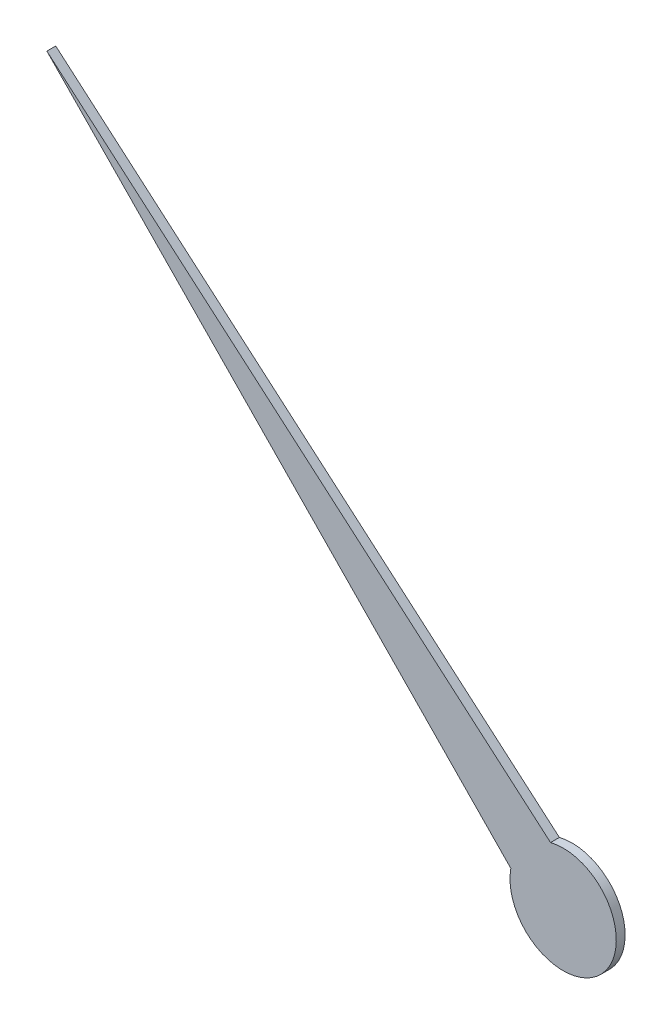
ISO-10303-21;
HEADER;
FILE_DESCRIPTION(('STEP AP214'),'2;1');
FILE_NAME('part.step','',(''),(''),'','','');
FILE_SCHEMA(('AUTOMOTIVE_DESIGN { 1 0 10303 214 1 1 1 1 }'));
ENDSEC;
DATA;
#1=APPLICATION_CONTEXT('core data for automotive mechanical design processes');
#2=APPLICATION_PROTOCOL_DEFINITION('international standard','automotive_design',2000,#1);
#3=PRODUCT_CONTEXT('',#1,'mechanical');
#4=PRODUCT('Part','Part','',(#3));
#5=PRODUCT_RELATED_PRODUCT_CATEGORY('part','',(#4));
#6=PRODUCT_DEFINITION_FORMATION('','',#4);
#7=PRODUCT_DEFINITION_CONTEXT('part definition',#1,'design');
#8=PRODUCT_DEFINITION('design','',#6,#7);
#9=PRODUCT_DEFINITION_SHAPE('','',#8);
#10=(LENGTH_UNIT() NAMED_UNIT(*) SI_UNIT(.MILLI.,.METRE.));
#11=(NAMED_UNIT(*) PLANE_ANGLE_UNIT() SI_UNIT($,.RADIAN.));
#12=(NAMED_UNIT(*) SI_UNIT($,.STERADIAN.) SOLID_ANGLE_UNIT());
#13=UNCERTAINTY_MEASURE_WITH_UNIT(LENGTH_MEASURE(1.E-05),#10,'distance_accuracy_value','');
#14=(GEOMETRIC_REPRESENTATION_CONTEXT(3) GLOBAL_UNCERTAINTY_ASSIGNED_CONTEXT((#13)) GLOBAL_UNIT_ASSIGNED_CONTEXT((#10,
#11,#12)) REPRESENTATION_CONTEXT('',''));
#15=CARTESIAN_POINT('',(0.,0.,0.));
#16=DIRECTION('',(0.,0.,1.));
#17=DIRECTION('',(1.,0.,0.));
#18=AXIS2_PLACEMENT_3D('',#15,#16,#17);
#19=CARTESIAN_POINT('',(-0.355628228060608,1.45723318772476,0.25));
#20=DIRECTION('',(-0.652400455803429,-0.75787442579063,0.));
#21=DIRECTION('',(0.75787442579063,-0.652400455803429,0.));
#22=AXIS2_PLACEMENT_3D('',#19,#20,#21);
#23=PLANE('',#22);
#24=DIRECTION('',(-0.75787442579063,0.652400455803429,0.));
#25=VECTOR('',#24,1.);
#26=CARTESIAN_POINT('',(-0.355628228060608,1.45723318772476,0.));
#27=LINE('',#26,#25);
#28=CARTESIAN_POINT('',(-0.355628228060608,1.45723318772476,0.));
#29=VERTEX_POINT('',#28);
#30=CARTESIAN_POINT('',(-14.5739157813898,13.696750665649,0.));
#31=VERTEX_POINT('',#30);
#32=EDGE_CURVE('E81',#29,#31,#27,.T.);
#33=ORIENTED_EDGE('',*,*,#32,.T.);
#34=DIRECTION('',(0.,0.,-1.));
#35=VECTOR('',#34,1.);
#36=CARTESIAN_POINT('',(-14.5739157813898,13.696750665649,0.25));
#37=LINE('',#36,#35);
#38=CARTESIAN_POINT('',(-14.5739157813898,13.696750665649,0.25));
#39=VERTEX_POINT('',#38);
#40=EDGE_CURVE('E11',#39,#31,#37,.T.);
#41=ORIENTED_EDGE('',*,*,#40,.F.);
#42=DIRECTION('',(-0.75787442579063,0.652400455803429,0.));
#43=VECTOR('',#42,1.);
#44=CARTESIAN_POINT('',(-0.355628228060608,1.45723318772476,0.25));
#45=LINE('',#44,#43);
#46=CARTESIAN_POINT('',(-0.355628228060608,1.45723318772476,0.25));
#47=VERTEX_POINT('',#46);
#48=EDGE_CURVE('E74',#47,#39,#45,.T.);
#49=ORIENTED_EDGE('',*,*,#48,.F.);
#50=DIRECTION('',(0.,0.,-1.));
#51=VECTOR('',#50,1.);
#52=CARTESIAN_POINT('',(-0.355628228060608,1.45723318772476,0.25));
#53=LINE('',#52,#51);
#54=EDGE_CURVE('E82',#47,#29,#53,.T.);
#55=ORIENTED_EDGE('',*,*,#54,.T.);
#56=EDGE_LOOP('',(#33,#41,#49,#55));
#57=FACE_BOUND('',#56,.T.);
#58=ADVANCED_FACE('F34',(#57),#23,.F.);
#59=CARTESIAN_POINT('',(-14.5739157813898,13.696750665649,0.25));
#60=DIRECTION('',(0.715970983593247,0.698130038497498,0.));
#61=DIRECTION('',(-0.698130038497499,0.715970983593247,0.));
#62=AXIS2_PLACEMENT_3D('',#59,#60,#61);
#63=PLANE('',#62);
#64=DIRECTION('',(0.698130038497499,-0.715970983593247,0.));
#65=VECTOR('',#64,1.);
#66=CARTESIAN_POINT('',(-14.5739157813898,13.696750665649,0.));
#67=LINE('',#66,#65);
#68=CARTESIAN_POINT('',(-1.47647734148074,0.264602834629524,0.));
#69=VERTEX_POINT('',#68);
#70=EDGE_CURVE('E62',#31,#69,#67,.T.);
#71=ORIENTED_EDGE('',*,*,#70,.T.);
#72=DIRECTION('',(0.,0.,-1.));
#73=VECTOR('',#72,1.);
#74=CARTESIAN_POINT('',(-1.47647734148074,0.264602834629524,0.25));
#75=LINE('',#74,#73);
#76=CARTESIAN_POINT('',(-1.47647734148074,0.264602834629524,0.25));
#77=VERTEX_POINT('',#76);
#78=EDGE_CURVE('E42',#77,#69,#75,.T.);
#79=ORIENTED_EDGE('',*,*,#78,.F.);
#80=DIRECTION('',(0.698130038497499,-0.715970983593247,0.));
#81=VECTOR('',#80,1.);
#82=CARTESIAN_POINT('',(-14.5739157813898,13.696750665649,0.25));
#83=LINE('',#82,#81);
#84=EDGE_CURVE('E70',#39,#77,#83,.T.);
#85=ORIENTED_EDGE('',*,*,#84,.F.);
#86=ORIENTED_EDGE('',*,*,#40,.T.);
#87=EDGE_LOOP('',(#71,#79,#85,#86));
#88=FACE_BOUND('',#87,.T.);
#89=ADVANCED_FACE('F71',(#88),#63,.F.);
#90=CARTESIAN_POINT('',(0.,0.,0.25));
#91=DIRECTION('',(0.,0.,-1.));
#92=DIRECTION('',(-1.,0.,0.));
#93=AXIS2_PLACEMENT_3D('',#90,#91,#92);
#94=CYLINDRICAL_SURFACE('',#93,1.5);
#95=CARTESIAN_POINT('',(0.,0.,0.));
#96=DIRECTION('',(0.,0.,1.));
#97=DIRECTION('',(1.,0.,0.));
#98=AXIS2_PLACEMENT_3D('',#95,#96,#97);
#99=CIRCLE('',#98,1.5);
#100=EDGE_CURVE('E67',#69,#29,#99,.T.);
#101=ORIENTED_EDGE('',*,*,#100,.T.);
#102=ORIENTED_EDGE('',*,*,#54,.F.);
#103=CARTESIAN_POINT('',(0.,0.,0.25));
#104=DIRECTION('',(0.,0.,1.));
#105=DIRECTION('',(1.,0.,0.));
#106=AXIS2_PLACEMENT_3D('',#103,#104,#105);
#107=CIRCLE('',#106,1.5);
#108=EDGE_CURVE('E50',#77,#47,#107,.T.);
#109=ORIENTED_EDGE('',*,*,#108,.F.);
#110=ORIENTED_EDGE('',*,*,#78,.T.);
#111=EDGE_LOOP('',(#101,#102,#109,#110));
#112=FACE_BOUND('',#111,.T.);
#113=ADVANCED_FACE('F89',(#112),#94,.T.);
#114=CARTESIAN_POINT('',(0.,0.,0.25));
#115=DIRECTION('',(0.,0.,1.));
#116=DIRECTION('',(1.,0.,0.));
#117=AXIS2_PLACEMENT_3D('',#114,#115,#116);
#118=PLANE('',#117);
#119=ORIENTED_EDGE('',*,*,#48,.T.);
#120=ORIENTED_EDGE('',*,*,#84,.T.);
#121=ORIENTED_EDGE('',*,*,#108,.T.);
#122=EDGE_LOOP('',(#119,#120,#121));
#123=FACE_BOUND('',#122,.T.);
#124=ADVANCED_FACE('F77',(#123),#118,.T.);
#125=CARTESIAN_POINT('',(0.,0.,0.));
#126=DIRECTION('',(0.,0.,1.));
#127=DIRECTION('',(1.,0.,0.));
#128=AXIS2_PLACEMENT_3D('',#125,#126,#127);
#129=PLANE('',#128);
#130=ORIENTED_EDGE('',*,*,#32,.F.);
#131=ORIENTED_EDGE('',*,*,#100,.F.);
#132=ORIENTED_EDGE('',*,*,#70,.F.);
#133=EDGE_LOOP('',(#130,#131,#132));
#134=FACE_BOUND('',#133,.T.);
#135=ADVANCED_FACE('F90',(#134),#129,.F.);
#136=CLOSED_SHELL('',(#58,#89,#113,#124,#135));
#137=MANIFOLD_SOLID_BREP('B2',#136);
#138=ADVANCED_BREP_SHAPE_REPRESENTATION('',(#18,#137),#14);
#139=SHAPE_DEFINITION_REPRESENTATION(#9,#138);
ENDSEC;
END-ISO-10303-21;
